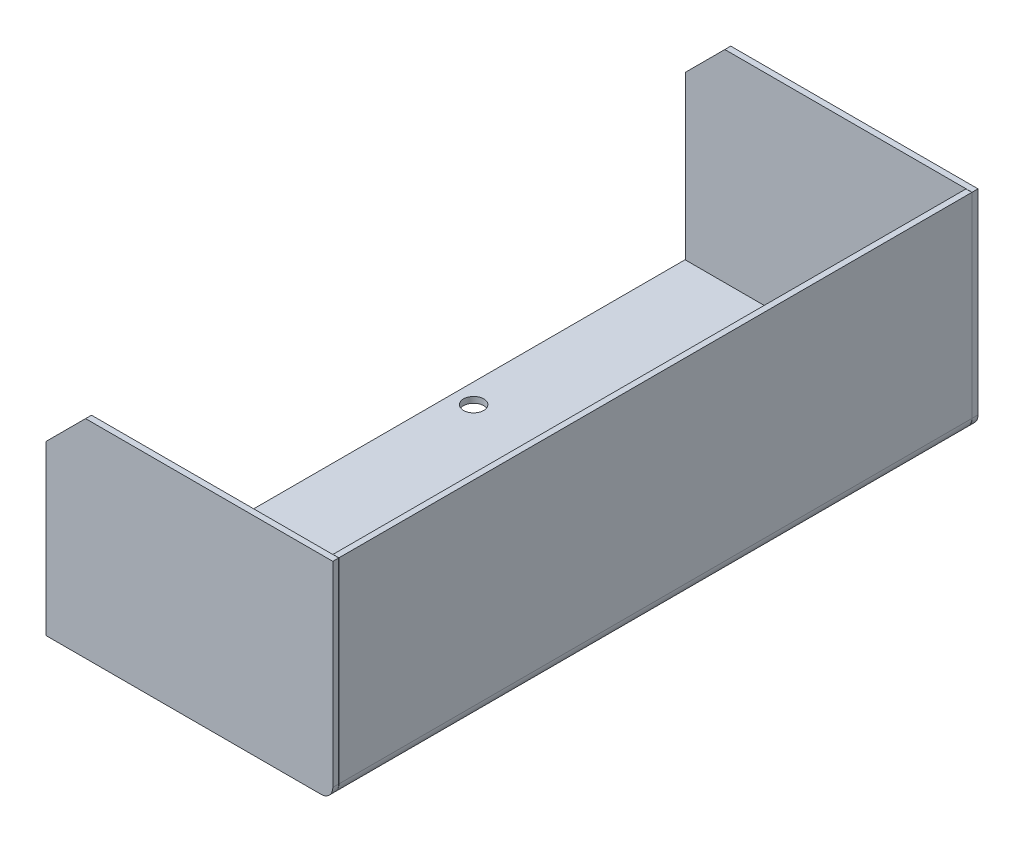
ISO-10303-21;
HEADER;
FILE_DESCRIPTION(('STEP AP214'),'2;1');
FILE_NAME('part.step','',(''),(''),'','','');
FILE_SCHEMA(('AUTOMOTIVE_DESIGN { 1 0 10303 214 1 1 1 1 }'));
ENDSEC;
DATA;
#1=APPLICATION_CONTEXT('core data for automotive mechanical design processes');
#2=APPLICATION_PROTOCOL_DEFINITION('international standard','automotive_design',2000,#1);
#3=PRODUCT_CONTEXT('',#1,'mechanical');
#4=PRODUCT('Part','Part','',(#3));
#5=PRODUCT_RELATED_PRODUCT_CATEGORY('part','',(#4));
#6=PRODUCT_DEFINITION_FORMATION('','',#4);
#7=PRODUCT_DEFINITION_CONTEXT('part definition',#1,'design');
#8=PRODUCT_DEFINITION('design','',#6,#7);
#9=PRODUCT_DEFINITION_SHAPE('','',#8);
#10=(LENGTH_UNIT() NAMED_UNIT(*) SI_UNIT(.MILLI.,.METRE.));
#11=(NAMED_UNIT(*) PLANE_ANGLE_UNIT() SI_UNIT($,.RADIAN.));
#12=(NAMED_UNIT(*) SI_UNIT($,.STERADIAN.) SOLID_ANGLE_UNIT());
#13=UNCERTAINTY_MEASURE_WITH_UNIT(LENGTH_MEASURE(1.E-05),#10,'distance_accuracy_value','');
#14=(GEOMETRIC_REPRESENTATION_CONTEXT(3) GLOBAL_UNCERTAINTY_ASSIGNED_CONTEXT((#13)) GLOBAL_UNIT_ASSIGNED_CONTEXT((#10,
#11,#12)) REPRESENTATION_CONTEXT('',''));
#15=CARTESIAN_POINT('',(0.,0.,0.));
#16=DIRECTION('',(0.,0.,1.));
#17=DIRECTION('',(1.,0.,0.));
#18=AXIS2_PLACEMENT_3D('',#15,#16,#17);
#19=CARTESIAN_POINT('',(-143.5,-1.49999999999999,323.1));
#20=DIRECTION('',(1.,0.,0.));
#21=DIRECTION('',(0.,0.,-1.));
#22=AXIS2_PLACEMENT_3D('',#19,#20,#21);
#23=PLANE('',#22);
#24=DIRECTION('',(0.,-1.,0.));
#25=VECTOR('',#24,1.);
#26=CARTESIAN_POINT('',(-143.5,-1.49999999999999,323.1));
#27=LINE('',#26,#25);
#28=CARTESIAN_POINT('',(-143.5,83.5,323.1));
#29=VERTEX_POINT('',#28);
#30=CARTESIAN_POINT('',(-143.5,-1.49999999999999,323.1));
#31=VERTEX_POINT('',#30);
#32=EDGE_CURVE('E135',#29,#31,#27,.T.);
#33=ORIENTED_EDGE('',*,*,#32,.F.);
#34=DIRECTION('',(0.,0.,-1.));
#35=VECTOR('',#34,1.);
#36=CARTESIAN_POINT('',(-143.5,83.5,323.1));
#37=LINE('',#36,#35);
#38=CARTESIAN_POINT('',(-143.5,83.5,320.1));
#39=VERTEX_POINT('',#38);
#40=EDGE_CURVE('E102',#29,#39,#37,.T.);
#41=ORIENTED_EDGE('',*,*,#40,.T.);
#42=DIRECTION('',(0.,-1.,0.));
#43=VECTOR('',#42,1.);
#44=CARTESIAN_POINT('',(-143.5,-1.49999999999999,320.1));
#45=LINE('',#44,#43);
#46=CARTESIAN_POINT('',(-143.5,-1.49999999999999,320.1));
#47=VERTEX_POINT('',#46);
#48=EDGE_CURVE('E96',#39,#47,#45,.T.);
#49=ORIENTED_EDGE('',*,*,#48,.T.);
#50=DIRECTION('',(0.,0.,-1.));
#51=VECTOR('',#50,1.);
#52=CARTESIAN_POINT('',(-143.5,-1.49999999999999,323.1));
#53=LINE('',#52,#51);
#54=EDGE_CURVE('E100',#31,#47,#53,.T.);
#55=ORIENTED_EDGE('',*,*,#54,.F.);
#56=EDGE_LOOP('',(#33,#41,#49,#55));
#57=FACE_BOUND('',#56,.T.);
#58=ADVANCED_FACE('F44',(#57),#23,.F.);
#59=CARTESIAN_POINT('',(-4.50000000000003,-1.49999999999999,323.1));
#60=DIRECTION('',(0.,1.,0.));
#61=DIRECTION('',(-1.,0.,0.));
#62=AXIS2_PLACEMENT_3D('',#59,#60,#61);
#63=PLANE('',#62);
#64=DIRECTION('',(1.,0.,0.));
#65=VECTOR('',#64,1.);
#66=CARTESIAN_POINT('',(-4.50000000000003,-1.49999999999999,320.1));
#67=LINE('',#66,#65);
#68=CARTESIAN_POINT('',(-4.50000000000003,-1.49999999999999,320.1));
#69=VERTEX_POINT('',#68);
#70=EDGE_CURVE('E103',#47,#69,#67,.T.);
#71=ORIENTED_EDGE('',*,*,#70,.T.);
#72=DIRECTION('',(0.,0.,-1.));
#73=VECTOR('',#72,1.);
#74=CARTESIAN_POINT('',(-4.50000000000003,-1.49999999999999,323.1));
#75=LINE('',#74,#73);
#76=CARTESIAN_POINT('',(-4.50000000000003,-1.49999999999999,323.1));
#77=VERTEX_POINT('',#76);
#78=EDGE_CURVE('E116',#77,#69,#75,.T.);
#79=ORIENTED_EDGE('',*,*,#78,.F.);
#80=DIRECTION('',(1.,0.,0.));
#81=VECTOR('',#80,1.);
#82=CARTESIAN_POINT('',(-4.50000000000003,-1.49999999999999,323.1));
#83=LINE('',#82,#81);
#84=EDGE_CURVE('E115',#31,#77,#83,.T.);
#85=ORIENTED_EDGE('',*,*,#84,.F.);
#86=ORIENTED_EDGE('',*,*,#54,.T.);
#87=EDGE_LOOP('',(#71,#79,#85,#86));
#88=FACE_BOUND('',#87,.T.);
#89=ADVANCED_FACE('F114',(#88),#63,.F.);
#90=CARTESIAN_POINT('',(-4.50000000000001,4.50000000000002,323.1));
#91=DIRECTION('',(0.,0.,-1.));
#92=DIRECTION('',(-1.,0.,0.));
#93=AXIS2_PLACEMENT_3D('',#90,#91,#92);
#94=CYLINDRICAL_SURFACE('',#93,6.00000000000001);
#95=CARTESIAN_POINT('',(-4.50000000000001,4.50000000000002,320.1));
#96=DIRECTION('',(0.,0.,1.));
#97=DIRECTION('',(-1.,0.,0.));
#98=AXIS2_PLACEMENT_3D('',#95,#96,#97);
#99=CIRCLE('',#98,6.00000000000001);
#100=CARTESIAN_POINT('',(1.50000000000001,4.50000000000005,320.1));
#101=VERTEX_POINT('',#100);
#102=EDGE_CURVE('E108',#69,#101,#99,.T.);
#103=ORIENTED_EDGE('',*,*,#102,.T.);
#104=DIRECTION('',(0.,0.,-1.));
#105=VECTOR('',#104,1.);
#106=CARTESIAN_POINT('',(1.50000000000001,4.50000000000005,323.1));
#107=LINE('',#106,#105);
#108=CARTESIAN_POINT('',(1.50000000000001,4.50000000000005,323.1));
#109=VERTEX_POINT('',#108);
#110=EDGE_CURVE('E119',#109,#101,#107,.T.);
#111=ORIENTED_EDGE('',*,*,#110,.F.);
#112=CARTESIAN_POINT('',(-4.50000000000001,4.50000000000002,323.1));
#113=DIRECTION('',(0.,0.,1.));
#114=DIRECTION('',(-1.,0.,0.));
#115=AXIS2_PLACEMENT_3D('',#112,#113,#114);
#116=CIRCLE('',#115,6.00000000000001);
#117=EDGE_CURVE('E132',#77,#109,#116,.T.);
#118=ORIENTED_EDGE('',*,*,#117,.F.);
#119=ORIENTED_EDGE('',*,*,#78,.T.);
#120=EDGE_LOOP('',(#103,#111,#118,#119));
#121=FACE_BOUND('',#120,.T.);
#122=ADVANCED_FACE('F143',(#121),#94,.T.);
#123=CARTESIAN_POINT('',(1.50000000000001,4.50000000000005,323.1));
#124=DIRECTION('',(-1.,0.,0.));
#125=DIRECTION('',(0.,-1.,0.));
#126=AXIS2_PLACEMENT_3D('',#123,#124,#125);
#127=PLANE('',#126);
#128=DIRECTION('',(0.,1.,0.));
#129=VECTOR('',#128,1.);
#130=CARTESIAN_POINT('',(1.50000000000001,4.50000000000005,320.1));
#131=LINE('',#130,#129);
#132=CARTESIAN_POINT('',(1.50000000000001,103.5,320.1));
#133=VERTEX_POINT('',#132);
#134=EDGE_CURVE('E139',#101,#133,#131,.T.);
#135=ORIENTED_EDGE('',*,*,#134,.T.);
#136=DIRECTION('',(0.,0.,-1.));
#137=VECTOR('',#136,1.);
#138=CARTESIAN_POINT('',(1.50000000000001,103.5,323.1));
#139=LINE('',#138,#137);
#140=CARTESIAN_POINT('',(1.50000000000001,103.5,323.1));
#141=VERTEX_POINT('',#140);
#142=EDGE_CURVE('E125',#141,#133,#139,.T.);
#143=ORIENTED_EDGE('',*,*,#142,.F.);
#144=DIRECTION('',(0.,1.,0.));
#145=VECTOR('',#144,1.);
#146=CARTESIAN_POINT('',(1.50000000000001,4.50000000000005,323.1));
#147=LINE('',#146,#145);
#148=EDGE_CURVE('E130',#109,#141,#147,.T.);
#149=ORIENTED_EDGE('',*,*,#148,.F.);
#150=ORIENTED_EDGE('',*,*,#110,.T.);
#151=EDGE_LOOP('',(#135,#143,#149,#150));
#152=FACE_BOUND('',#151,.T.);
#153=ADVANCED_FACE('F147',(#152),#127,.F.);
#154=CARTESIAN_POINT('',(-143.5,103.5,323.1));
#155=DIRECTION('',(0.,-1.,0.));
#156=DIRECTION('',(0.,0.,-1.));
#157=AXIS2_PLACEMENT_3D('',#154,#155,#156);
#158=PLANE('',#157);
#159=DIRECTION('',(-1.,0.,0.));
#160=VECTOR('',#159,1.);
#161=CARTESIAN_POINT('',(-143.5,103.5,320.1));
#162=LINE('',#161,#160);
#163=CARTESIAN_POINT('',(-123.5,103.5,320.1));
#164=VERTEX_POINT('',#163);
#165=EDGE_CURVE('E137',#133,#164,#162,.T.);
#166=ORIENTED_EDGE('',*,*,#165,.T.);
#167=DIRECTION('',(0.,0.,1.));
#168=VECTOR('',#167,1.);
#169=CARTESIAN_POINT('',(-123.5,103.5,323.1));
#170=LINE('',#169,#168);
#171=CARTESIAN_POINT('',(-123.5,103.5,323.1));
#172=VERTEX_POINT('',#171);
#173=EDGE_CURVE('E51',#164,#172,#170,.T.);
#174=ORIENTED_EDGE('',*,*,#173,.T.);
#175=DIRECTION('',(-1.,0.,0.));
#176=VECTOR('',#175,1.);
#177=CARTESIAN_POINT('',(-143.5,103.5,323.1));
#178=LINE('',#177,#176);
#179=EDGE_CURVE('E128',#141,#172,#178,.T.);
#180=ORIENTED_EDGE('',*,*,#179,.F.);
#181=ORIENTED_EDGE('',*,*,#142,.T.);
#182=EDGE_LOOP('',(#166,#174,#180,#181));
#183=FACE_BOUND('',#182,.T.);
#184=ADVANCED_FACE('F149',(#183),#158,.F.);
#185=CARTESIAN_POINT('',(-4.50000000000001,4.50000000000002,323.1));
#186=DIRECTION('',(0.,0.,-1.));
#187=DIRECTION('',(-1.,0.,0.));
#188=AXIS2_PLACEMENT_3D('',#185,#186,#187);
#189=PLANE('',#188);
#190=ORIENTED_EDGE('',*,*,#179,.T.);
#191=DIRECTION('',(0.707106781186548,0.707106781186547,0.));
#192=VECTOR('',#191,1.);
#193=CARTESIAN_POINT('',(-143.5,83.5,323.1));
#194=LINE('',#193,#192);
#195=EDGE_CURVE('E13',#172,#29,#194,.F.);
#196=ORIENTED_EDGE('',*,*,#195,.T.);
#197=ORIENTED_EDGE('',*,*,#32,.T.);
#198=ORIENTED_EDGE('',*,*,#84,.T.);
#199=ORIENTED_EDGE('',*,*,#117,.T.);
#200=ORIENTED_EDGE('',*,*,#148,.T.);
#201=EDGE_LOOP('',(#190,#196,#197,#198,#199,#200));
#202=FACE_BOUND('',#201,.T.);
#203=ADVANCED_FACE('F154',(#202),#189,.F.);
#204=CARTESIAN_POINT('',(-4.50000000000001,4.50000000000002,320.1));
#205=DIRECTION('',(0.,0.,-1.));
#206=DIRECTION('',(-1.,0.,0.));
#207=AXIS2_PLACEMENT_3D('',#204,#205,#206);
#208=PLANE('',#207);
#209=ORIENTED_EDGE('',*,*,#48,.F.);
#210=DIRECTION('',(-0.707106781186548,-0.707106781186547,0.));
#211=VECTOR('',#210,1.);
#212=CARTESIAN_POINT('',(-113.5,113.5,320.1));
#213=LINE('',#212,#211);
#214=EDGE_CURVE('E65',#39,#164,#213,.F.);
#215=ORIENTED_EDGE('',*,*,#214,.T.);
#216=ORIENTED_EDGE('',*,*,#165,.F.);
#217=ORIENTED_EDGE('',*,*,#134,.F.);
#218=ORIENTED_EDGE('',*,*,#102,.F.);
#219=ORIENTED_EDGE('',*,*,#70,.F.);
#220=EDGE_LOOP('',(#209,#215,#216,#217,#218,#219));
#221=FACE_BOUND('',#220,.T.);
#222=ADVANCED_FACE('F106',(#221),#208,.T.);
#223=CARTESIAN_POINT('',(-143.5,83.5,323.1));
#224=DIRECTION('',(0.707106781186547,-0.707106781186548,0.));
#225=DIRECTION('',(0.707106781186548,0.707106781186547,0.));
#226=AXIS2_PLACEMENT_3D('',#223,#224,#225);
#227=PLANE('',#226);
#228=ORIENTED_EDGE('',*,*,#195,.F.);
#229=ORIENTED_EDGE('',*,*,#173,.F.);
#230=ORIENTED_EDGE('',*,*,#214,.F.);
#231=ORIENTED_EDGE('',*,*,#40,.F.);
#232=EDGE_LOOP('',(#228,#229,#230,#231));
#233=FACE_BOUND('',#232,.T.);
#234=ADVANCED_FACE('F152',(#233),#227,.F.);
#235=CLOSED_SHELL('',(#58,#89,#122,#153,#184,#203,#222,#234));
#236=MANIFOLD_SOLID_BREP('B2',#235);
#237=CARTESIAN_POINT('',(1.50000000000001,103.5,-3.1));
#238=DIRECTION('',(-1.,0.,0.));
#239=DIRECTION('',(0.,-1.,0.));
#240=AXIS2_PLACEMENT_3D('',#237,#238,#239);
#241=PLANE('',#240);
#242=DIRECTION('',(0.,-1.,0.));
#243=VECTOR('',#242,1.);
#244=CARTESIAN_POINT('',(1.50000000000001,103.5,-0.1));
#245=LINE('',#244,#243);
#246=CARTESIAN_POINT('',(1.50000000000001,103.5,-0.1));
#247=VERTEX_POINT('',#246);
#248=CARTESIAN_POINT('',(1.5,4.50000000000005,-0.1));
#249=VERTEX_POINT('',#248);
#250=EDGE_CURVE('E283',#247,#249,#245,.T.);
#251=ORIENTED_EDGE('',*,*,#250,.T.);
#252=DIRECTION('',(0.,0.,1.));
#253=VECTOR('',#252,1.);
#254=CARTESIAN_POINT('',(1.5,4.50000000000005,-3.1));
#255=LINE('',#254,#253);
#256=CARTESIAN_POINT('',(1.5,4.50000000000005,-3.1));
#257=VERTEX_POINT('',#256);
#258=EDGE_CURVE('E290',#257,#249,#255,.T.);
#259=ORIENTED_EDGE('',*,*,#258,.F.);
#260=DIRECTION('',(0.,-1.,0.));
#261=VECTOR('',#260,1.);
#262=CARTESIAN_POINT('',(1.50000000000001,103.5,-3.1));
#263=LINE('',#262,#261);
#264=CARTESIAN_POINT('',(1.50000000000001,103.5,-3.1));
#265=VERTEX_POINT('',#264);
#266=EDGE_CURVE('E309',#265,#257,#263,.T.);
#267=ORIENTED_EDGE('',*,*,#266,.F.);
#268=DIRECTION('',(0.,0.,1.));
#269=VECTOR('',#268,1.);
#270=CARTESIAN_POINT('',(1.50000000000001,103.5,-3.1));
#271=LINE('',#270,#269);
#272=EDGE_CURVE('E301',#265,#247,#271,.T.);
#273=ORIENTED_EDGE('',*,*,#272,.T.);
#274=EDGE_LOOP('',(#251,#259,#267,#273));
#275=FACE_BOUND('',#274,.T.);
#276=ADVANCED_FACE('F228',(#275),#241,.F.);
#277=CARTESIAN_POINT('',(-4.5,4.50000000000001,-3.1));
#278=DIRECTION('',(0.,0.,1.));
#279=DIRECTION('',(1.,0.,0.));
#280=AXIS2_PLACEMENT_3D('',#277,#278,#279);
#281=CYLINDRICAL_SURFACE('',#280,6.);
#282=CARTESIAN_POINT('',(-4.5,4.50000000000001,-0.1));
#283=DIRECTION('',(0.,0.,-1.));
#284=DIRECTION('',(-1.,0.,0.));
#285=AXIS2_PLACEMENT_3D('',#282,#283,#284);
#286=CIRCLE('',#285,6.);
#287=CARTESIAN_POINT('',(-4.50000000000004,-1.49999999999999,-0.1));
#288=VERTEX_POINT('',#287);
#289=EDGE_CURVE('E279',#249,#288,#286,.T.);
#290=ORIENTED_EDGE('',*,*,#289,.T.);
#291=DIRECTION('',(0.,0.,1.));
#292=VECTOR('',#291,1.);
#293=CARTESIAN_POINT('',(-4.50000000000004,-1.49999999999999,-3.1));
#294=LINE('',#293,#292);
#295=CARTESIAN_POINT('',(-4.50000000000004,-1.49999999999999,-3.1));
#296=VERTEX_POINT('',#295);
#297=EDGE_CURVE('E297',#296,#288,#294,.T.);
#298=ORIENTED_EDGE('',*,*,#297,.F.);
#299=CARTESIAN_POINT('',(-4.5,4.50000000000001,-3.1));
#300=DIRECTION('',(0.,0.,-1.));
#301=DIRECTION('',(-1.,0.,0.));
#302=AXIS2_PLACEMENT_3D('',#299,#300,#301);
#303=CIRCLE('',#302,6.);
#304=EDGE_CURVE('E292',#257,#296,#303,.T.);
#305=ORIENTED_EDGE('',*,*,#304,.F.);
#306=ORIENTED_EDGE('',*,*,#258,.T.);
#307=EDGE_LOOP('',(#290,#298,#305,#306));
#308=FACE_BOUND('',#307,.T.);
#309=ADVANCED_FACE('F291',(#308),#281,.T.);
#310=CARTESIAN_POINT('',(-4.50000000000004,-1.49999999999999,-3.1));
#311=DIRECTION('',(0.,1.,0.));
#312=DIRECTION('',(0.,0.,1.));
#313=AXIS2_PLACEMENT_3D('',#310,#311,#312);
#314=PLANE('',#313);
#315=DIRECTION('',(-1.,0.,0.));
#316=VECTOR('',#315,1.);
#317=CARTESIAN_POINT('',(-4.50000000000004,-1.49999999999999,-0.1));
#318=LINE('',#317,#316);
#319=CARTESIAN_POINT('',(-143.5,-1.49999999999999,-0.1));
#320=VERTEX_POINT('',#319);
#321=EDGE_CURVE('E284',#288,#320,#318,.T.);
#322=ORIENTED_EDGE('',*,*,#321,.T.);
#323=DIRECTION('',(0.,0.,1.));
#324=VECTOR('',#323,1.);
#325=CARTESIAN_POINT('',(-143.5,-1.49999999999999,-3.1));
#326=LINE('',#325,#324);
#327=CARTESIAN_POINT('',(-143.5,-1.49999999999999,-3.1));
#328=VERTEX_POINT('',#327);
#329=EDGE_CURVE('E319',#328,#320,#326,.T.);
#330=ORIENTED_EDGE('',*,*,#329,.F.);
#331=DIRECTION('',(-1.,0.,0.));
#332=VECTOR('',#331,1.);
#333=CARTESIAN_POINT('',(-4.50000000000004,-1.49999999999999,-3.1));
#334=LINE('',#333,#332);
#335=EDGE_CURVE('E312',#296,#328,#334,.T.);
#336=ORIENTED_EDGE('',*,*,#335,.F.);
#337=ORIENTED_EDGE('',*,*,#297,.T.);
#338=EDGE_LOOP('',(#322,#330,#336,#337));
#339=FACE_BOUND('',#338,.T.);
#340=ADVANCED_FACE('F338',(#339),#314,.F.);
#341=CARTESIAN_POINT('',(-143.5,103.5,-3.1));
#342=DIRECTION('',(1.,0.,0.));
#343=DIRECTION('',(0.,0.,-1.));
#344=AXIS2_PLACEMENT_3D('',#341,#342,#343);
#345=PLANE('',#344);
#346=DIRECTION('',(0.,1.,0.));
#347=VECTOR('',#346,1.);
#348=CARTESIAN_POINT('',(-143.5,103.5,-0.1));
#349=LINE('',#348,#347);
#350=CARTESIAN_POINT('',(-143.5,83.4999999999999,-0.1));
#351=VERTEX_POINT('',#350);
#352=EDGE_CURVE('E305',#320,#351,#349,.T.);
#353=ORIENTED_EDGE('',*,*,#352,.T.);
#354=DIRECTION('',(0.,0.,-1.));
#355=VECTOR('',#354,1.);
#356=CARTESIAN_POINT('',(-143.5,83.4999999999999,-3.1));
#357=LINE('',#356,#355);
#358=CARTESIAN_POINT('',(-143.5,83.4999999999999,-3.1));
#359=VERTEX_POINT('',#358);
#360=EDGE_CURVE('E235',#351,#359,#357,.T.);
#361=ORIENTED_EDGE('',*,*,#360,.T.);
#362=DIRECTION('',(0.,1.,0.));
#363=VECTOR('',#362,1.);
#364=CARTESIAN_POINT('',(-143.5,103.5,-3.1));
#365=LINE('',#364,#363);
#366=EDGE_CURVE('E314',#328,#359,#365,.T.);
#367=ORIENTED_EDGE('',*,*,#366,.F.);
#368=ORIENTED_EDGE('',*,*,#329,.T.);
#369=EDGE_LOOP('',(#353,#361,#367,#368));
#370=FACE_BOUND('',#369,.T.);
#371=ADVANCED_FACE('F336',(#370),#345,.F.);
#372=CARTESIAN_POINT('',(1.50000000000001,103.5,-3.1));
#373=DIRECTION('',(0.,-1.,0.));
#374=DIRECTION('',(0.,0.,-1.));
#375=AXIS2_PLACEMENT_3D('',#372,#373,#374);
#376=PLANE('',#375);
#377=DIRECTION('',(1.,0.,0.));
#378=VECTOR('',#377,1.);
#379=CARTESIAN_POINT('',(1.50000000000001,103.5,-3.1));
#380=LINE('',#379,#378);
#381=CARTESIAN_POINT('',(-123.5,103.5,-3.1));
#382=VERTEX_POINT('',#381);
#383=EDGE_CURVE('E316',#382,#265,#380,.T.);
#384=ORIENTED_EDGE('',*,*,#383,.F.);
#385=DIRECTION('',(0.,0.,1.));
#386=VECTOR('',#385,1.);
#387=CARTESIAN_POINT('',(-123.5,103.5,-3.1));
#388=LINE('',#387,#386);
#389=CARTESIAN_POINT('',(-123.5,103.5,-0.0999999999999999));
#390=VERTEX_POINT('',#389);
#391=EDGE_CURVE('E296',#382,#390,#388,.T.);
#392=ORIENTED_EDGE('',*,*,#391,.T.);
#393=DIRECTION('',(1.,0.,0.));
#394=VECTOR('',#393,1.);
#395=CARTESIAN_POINT('',(1.50000000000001,103.5,-0.1));
#396=LINE('',#395,#394);
#397=EDGE_CURVE('E307',#390,#247,#396,.T.);
#398=ORIENTED_EDGE('',*,*,#397,.T.);
#399=ORIENTED_EDGE('',*,*,#272,.F.);
#400=EDGE_LOOP('',(#384,#392,#398,#399));
#401=FACE_BOUND('',#400,.T.);
#402=ADVANCED_FACE('F328',(#401),#376,.F.);
#403=CARTESIAN_POINT('',(-4.5,4.50000000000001,-3.1));
#404=DIRECTION('',(0.,0.,-1.));
#405=DIRECTION('',(-1.,0.,0.));
#406=AXIS2_PLACEMENT_3D('',#403,#404,#405);
#407=PLANE('',#406);
#408=ORIENTED_EDGE('',*,*,#366,.T.);
#409=DIRECTION('',(-0.707106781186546,-0.707106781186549,0.));
#410=VECTOR('',#409,1.);
#411=CARTESIAN_POINT('',(-113.5,113.5,-3.1));
#412=LINE('',#411,#410);
#413=EDGE_CURVE('E42',#359,#382,#412,.F.);
#414=ORIENTED_EDGE('',*,*,#413,.T.);
#415=ORIENTED_EDGE('',*,*,#383,.T.);
#416=ORIENTED_EDGE('',*,*,#266,.T.);
#417=ORIENTED_EDGE('',*,*,#304,.T.);
#418=ORIENTED_EDGE('',*,*,#335,.T.);
#419=EDGE_LOOP('',(#408,#414,#415,#416,#417,#418));
#420=FACE_BOUND('',#419,.T.);
#421=ADVANCED_FACE('F333',(#420),#407,.T.);
#422=CARTESIAN_POINT('',(-4.5,4.50000000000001,-0.1));
#423=DIRECTION('',(0.,0.,-1.));
#424=DIRECTION('',(-1.,0.,0.));
#425=AXIS2_PLACEMENT_3D('',#422,#423,#424);
#426=PLANE('',#425);
#427=ORIENTED_EDGE('',*,*,#397,.F.);
#428=DIRECTION('',(0.707106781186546,0.707106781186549,0.));
#429=VECTOR('',#428,1.);
#430=CARTESIAN_POINT('',(-123.5,103.5,-0.0999999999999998));
#431=LINE('',#430,#429);
#432=EDGE_CURVE('E249',#390,#351,#431,.F.);
#433=ORIENTED_EDGE('',*,*,#432,.T.);
#434=ORIENTED_EDGE('',*,*,#352,.F.);
#435=ORIENTED_EDGE('',*,*,#321,.F.);
#436=ORIENTED_EDGE('',*,*,#289,.F.);
#437=ORIENTED_EDGE('',*,*,#250,.F.);
#438=EDGE_LOOP('',(#427,#433,#434,#435,#436,#437));
#439=FACE_BOUND('',#438,.T.);
#440=ADVANCED_FACE('F281',(#439),#426,.F.);
#441=CARTESIAN_POINT('',(-123.5,103.5,-3.1));
#442=DIRECTION('',(0.707106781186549,-0.707106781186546,0.));
#443=DIRECTION('',(0.707106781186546,0.707106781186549,0.));
#444=AXIS2_PLACEMENT_3D('',#441,#442,#443);
#445=PLANE('',#444);
#446=ORIENTED_EDGE('',*,*,#413,.F.);
#447=ORIENTED_EDGE('',*,*,#360,.F.);
#448=ORIENTED_EDGE('',*,*,#432,.F.);
#449=ORIENTED_EDGE('',*,*,#391,.F.);
#450=EDGE_LOOP('',(#446,#447,#448,#449));
#451=FACE_BOUND('',#450,.T.);
#452=ADVANCED_FACE('F331',(#451),#445,.F.);
#453=CLOSED_SHELL('',(#276,#309,#340,#371,#402,#421,#440,#452));
#454=MANIFOLD_SOLID_BREP('B7',#453);
#455=CARTESIAN_POINT('',(-143.5,-1.49999999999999,320.));
#456=DIRECTION('',(1.,0.,0.));
#457=DIRECTION('',(0.,0.,-1.));
#458=AXIS2_PLACEMENT_3D('',#455,#456,#457);
#459=PLANE('',#458);
#460=DIRECTION('',(0.,-1.,0.));
#461=VECTOR('',#460,1.);
#462=CARTESIAN_POINT('',(-143.5,-1.49999999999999,0.));
#463=LINE('',#462,#461);
#464=CARTESIAN_POINT('',(-143.5,1.5,0.));
#465=VERTEX_POINT('',#464);
#466=CARTESIAN_POINT('',(-143.5,-1.49999999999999,0.));
#467=VERTEX_POINT('',#466);
#468=EDGE_CURVE('E471',#465,#467,#463,.T.);
#469=ORIENTED_EDGE('',*,*,#468,.T.);
#470=DIRECTION('',(0.,0.,-1.));
#471=VECTOR('',#470,1.);
#472=CARTESIAN_POINT('',(-143.5,-1.49999999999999,320.));
#473=LINE('',#472,#471);
#474=CARTESIAN_POINT('',(-143.5,-1.49999999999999,320.));
#475=VERTEX_POINT('',#474);
#476=EDGE_CURVE('E226',#475,#467,#473,.T.);
#477=ORIENTED_EDGE('',*,*,#476,.F.);
#478=DIRECTION('',(0.,-1.,0.));
#479=VECTOR('',#478,1.);
#480=CARTESIAN_POINT('',(-143.5,-1.49999999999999,320.));
#481=LINE('',#480,#479);
#482=CARTESIAN_POINT('',(-143.5,1.5,320.));
#483=VERTEX_POINT('',#482);
#484=EDGE_CURVE('E503',#483,#475,#481,.T.);
#485=ORIENTED_EDGE('',*,*,#484,.F.);
#486=DIRECTION('',(0.,0.,-1.));
#487=VECTOR('',#486,1.);
#488=CARTESIAN_POINT('',(-143.5,1.5,320.));
#489=LINE('',#488,#487);
#490=EDGE_CURVE('E484',#483,#465,#489,.T.);
#491=ORIENTED_EDGE('',*,*,#490,.T.);
#492=EDGE_LOOP('',(#469,#477,#485,#491));
#493=FACE_BOUND('',#492,.T.);
#494=ADVANCED_FACE('F403',(#493),#459,.F.);
#495=CARTESIAN_POINT('',(-143.5,-1.49999999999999,320.));
#496=DIRECTION('',(0.,1.,0.));
#497=DIRECTION('',(-1.,0.,0.));
#498=AXIS2_PLACEMENT_3D('',#495,#496,#497);
#499=PLANE('',#498);
#500=CARTESIAN_POINT('',(-61.,-1.49999999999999,13.9));
#501=DIRECTION('',(0.,-1.,0.));
#502=DIRECTION('',(1.,0.,0.));
#503=AXIS2_PLACEMENT_3D('',#500,#501,#502);
#504=CIRCLE('',#503,4.1);
#505=CARTESIAN_POINT('',(-56.9,-1.49999999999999,13.9));
#506=VERTEX_POINT('',#505);
#507=EDGE_CURVE('E651',#506,#506,#504,.T.);
#508=ORIENTED_EDGE('',*,*,#507,.F.);
#509=EDGE_LOOP('',(#508));
#510=FACE_BOUND('',#509,.T.);
#511=CARTESIAN_POINT('',(-133.5,-1.49999999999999,116.9));
#512=DIRECTION('',(0.,-1.,0.));
#513=DIRECTION('',(1.,0.,0.));
#514=AXIS2_PLACEMENT_3D('',#511,#512,#513);
#515=CIRCLE('',#514,5.09999999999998);
#516=CARTESIAN_POINT('',(-128.4,-1.49999999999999,116.9));
#517=VERTEX_POINT('',#516);
#518=EDGE_CURVE('E654',#517,#517,#515,.T.);
#519=ORIENTED_EDGE('',*,*,#518,.F.);
#520=EDGE_LOOP('',(#519));
#521=FACE_BOUND('',#520,.T.);
#522=CARTESIAN_POINT('',(-101.,-1.49999999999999,266.9));
#523=DIRECTION('',(0.,-1.,0.));
#524=DIRECTION('',(1.,0.,0.));
#525=AXIS2_PLACEMENT_3D('',#522,#523,#524);
#526=CIRCLE('',#525,4.09999999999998);
#527=CARTESIAN_POINT('',(-96.9,-1.49999999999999,266.9));
#528=VERTEX_POINT('',#527);
#529=EDGE_CURVE('E488',#528,#528,#526,.T.);
#530=ORIENTED_EDGE('',*,*,#529,.F.);
#531=EDGE_LOOP('',(#530));
#532=FACE_BOUND('',#531,.T.);
#533=DIRECTION('',(1.,0.,0.));
#534=VECTOR('',#533,1.);
#535=CARTESIAN_POINT('',(-143.5,-1.49999999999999,0.));
#536=LINE('',#535,#534);
#537=CARTESIAN_POINT('',(-4.50000000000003,-1.49999999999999,0.));
#538=VERTEX_POINT('',#537);
#539=EDGE_CURVE('E467',#467,#538,#536,.T.);
#540=ORIENTED_EDGE('',*,*,#539,.T.);
#541=DIRECTION('',(0.,0.,-1.));
#542=VECTOR('',#541,1.);
#543=CARTESIAN_POINT('',(-4.50000000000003,-1.49999999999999,320.));
#544=LINE('',#543,#542);
#545=CARTESIAN_POINT('',(-4.50000000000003,-1.49999999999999,320.));
#546=VERTEX_POINT('',#545);
#547=EDGE_CURVE('E410',#546,#538,#544,.T.);
#548=ORIENTED_EDGE('',*,*,#547,.F.);
#549=DIRECTION('',(1.,0.,0.));
#550=VECTOR('',#549,1.);
#551=CARTESIAN_POINT('',(-143.5,-1.49999999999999,320.));
#552=LINE('',#551,#550);
#553=EDGE_CURVE('E480',#475,#546,#552,.T.);
#554=ORIENTED_EDGE('',*,*,#553,.F.);
#555=ORIENTED_EDGE('',*,*,#476,.T.);
#556=EDGE_LOOP('',(#540,#548,#554,#555));
#557=FACE_BOUND('',#556,.T.);
#558=ADVANCED_FACE('F479',(#510,#521,#532,#557),#499,.F.);
#559=CARTESIAN_POINT('',(-4.49999999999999,4.50000000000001,320.));
#560=DIRECTION('',(0.,0.,-1.));
#561=DIRECTION('',(-1.,0.,0.));
#562=AXIS2_PLACEMENT_3D('',#559,#560,#561);
#563=CYLINDRICAL_SURFACE('',#562,6.);
#564=CARTESIAN_POINT('',(-4.49999999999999,4.50000000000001,0.));
#565=DIRECTION('',(0.,0.,1.));
#566=DIRECTION('',(-1.,0.,0.));
#567=AXIS2_PLACEMENT_3D('',#564,#565,#566);
#568=CIRCLE('',#567,6.);
#569=CARTESIAN_POINT('',(1.50000000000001,4.50000000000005,0.));
#570=VERTEX_POINT('',#569);
#571=EDGE_CURVE('E473',#538,#570,#568,.T.);
#572=ORIENTED_EDGE('',*,*,#571,.T.);
#573=DIRECTION('',(0.,0.,-1.));
#574=VECTOR('',#573,1.);
#575=CARTESIAN_POINT('',(1.50000000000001,4.50000000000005,320.));
#576=LINE('',#575,#574);
#577=CARTESIAN_POINT('',(1.50000000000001,4.50000000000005,320.));
#578=VERTEX_POINT('',#577);
#579=EDGE_CURVE('E529',#578,#570,#576,.T.);
#580=ORIENTED_EDGE('',*,*,#579,.F.);
#581=CARTESIAN_POINT('',(-4.49999999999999,4.50000000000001,320.));
#582=DIRECTION('',(0.,0.,1.));
#583=DIRECTION('',(-1.,0.,0.));
#584=AXIS2_PLACEMENT_3D('',#581,#582,#583);
#585=CIRCLE('',#584,6.);
#586=EDGE_CURVE('E506',#546,#578,#585,.T.);
#587=ORIENTED_EDGE('',*,*,#586,.F.);
#588=ORIENTED_EDGE('',*,*,#547,.T.);
#589=EDGE_LOOP('',(#572,#580,#587,#588));
#590=FACE_BOUND('',#589,.T.);
#591=ADVANCED_FACE('F533',(#590),#563,.T.);
#592=CARTESIAN_POINT('',(1.49999999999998,103.5,320.));
#593=DIRECTION('',(-1.,0.,0.));
#594=DIRECTION('',(0.,-1.,0.));
#595=AXIS2_PLACEMENT_3D('',#592,#593,#594);
#596=PLANE('',#595);
#597=DIRECTION('',(0.,1.,0.));
#598=VECTOR('',#597,1.);
#599=CARTESIAN_POINT('',(1.49999999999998,103.5,0.));
#600=LINE('',#599,#598);
#601=CARTESIAN_POINT('',(1.49999999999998,103.5,0.));
#602=VERTEX_POINT('',#601);
#603=EDGE_CURVE('E493',#570,#602,#600,.T.);
#604=ORIENTED_EDGE('',*,*,#603,.T.);
#605=DIRECTION('',(0.,0.,-1.));
#606=VECTOR('',#605,1.);
#607=CARTESIAN_POINT('',(1.49999999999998,103.5,320.));
#608=LINE('',#607,#606);
#609=CARTESIAN_POINT('',(1.49999999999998,103.5,320.));
#610=VERTEX_POINT('',#609);
#611=EDGE_CURVE('E526',#610,#602,#608,.T.);
#612=ORIENTED_EDGE('',*,*,#611,.F.);
#613=DIRECTION('',(0.,1.,0.));
#614=VECTOR('',#613,1.);
#615=CARTESIAN_POINT('',(1.49999999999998,103.5,320.));
#616=LINE('',#615,#614);
#617=EDGE_CURVE('E508',#578,#610,#616,.T.);
#618=ORIENTED_EDGE('',*,*,#617,.F.);
#619=ORIENTED_EDGE('',*,*,#579,.T.);
#620=EDGE_LOOP('',(#604,#612,#618,#619));
#621=FACE_BOUND('',#620,.T.);
#622=ADVANCED_FACE('F541',(#621),#596,.F.);
#623=CARTESIAN_POINT('',(1.49999999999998,103.5,320.));
#624=DIRECTION('',(0.,-1.,0.));
#625=DIRECTION('',(0.,0.,-1.));
#626=AXIS2_PLACEMENT_3D('',#623,#624,#625);
#627=PLANE('',#626);
#628=DIRECTION('',(-1.,0.,0.));
#629=VECTOR('',#628,1.);
#630=CARTESIAN_POINT('',(1.49999999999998,103.5,0.));
#631=LINE('',#630,#629);
#632=CARTESIAN_POINT('',(-1.50000000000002,103.5,0.));
#633=VERTEX_POINT('',#632);
#634=EDGE_CURVE('E495',#602,#633,#631,.T.);
#635=ORIENTED_EDGE('',*,*,#634,.T.);
#636=DIRECTION('',(0.,0.,-1.));
#637=VECTOR('',#636,1.);
#638=CARTESIAN_POINT('',(-1.50000000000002,103.5,320.));
#639=LINE('',#638,#637);
#640=CARTESIAN_POINT('',(-1.50000000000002,103.5,320.));
#641=VERTEX_POINT('',#640);
#642=EDGE_CURVE('E523',#641,#633,#639,.T.);
#643=ORIENTED_EDGE('',*,*,#642,.F.);
#644=DIRECTION('',(-1.,0.,0.));
#645=VECTOR('',#644,1.);
#646=CARTESIAN_POINT('',(1.49999999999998,103.5,320.));
#647=LINE('',#646,#645);
#648=EDGE_CURVE('E510',#610,#641,#647,.T.);
#649=ORIENTED_EDGE('',*,*,#648,.F.);
#650=ORIENTED_EDGE('',*,*,#611,.T.);
#651=EDGE_LOOP('',(#635,#643,#649,#650));
#652=FACE_BOUND('',#651,.T.);
#653=ADVANCED_FACE('F544',(#652),#627,.F.);
#654=CARTESIAN_POINT('',(-1.50000000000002,103.5,320.));
#655=DIRECTION('',(1.,0.,0.));
#656=DIRECTION('',(0.,1.,0.));
#657=AXIS2_PLACEMENT_3D('',#654,#655,#656);
#658=PLANE('',#657);
#659=DIRECTION('',(0.,-1.,0.));
#660=VECTOR('',#659,1.);
#661=CARTESIAN_POINT('',(-1.50000000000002,103.5,0.));
#662=LINE('',#661,#660);
#663=CARTESIAN_POINT('',(-1.50000000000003,4.50000000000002,0.));
#664=VERTEX_POINT('',#663);
#665=EDGE_CURVE('E497',#633,#664,#662,.T.);
#666=ORIENTED_EDGE('',*,*,#665,.T.);
#667=DIRECTION('',(0.,0.,-1.));
#668=VECTOR('',#667,1.);
#669=CARTESIAN_POINT('',(-1.50000000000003,4.50000000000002,320.));
#670=LINE('',#669,#668);
#671=CARTESIAN_POINT('',(-1.50000000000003,4.50000000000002,320.));
#672=VERTEX_POINT('',#671);
#673=EDGE_CURVE('E520',#672,#664,#670,.T.);
#674=ORIENTED_EDGE('',*,*,#673,.F.);
#675=DIRECTION('',(0.,-1.,0.));
#676=VECTOR('',#675,1.);
#677=CARTESIAN_POINT('',(-1.50000000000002,103.5,320.));
#678=LINE('',#677,#676);
#679=EDGE_CURVE('E512',#641,#672,#678,.T.);
#680=ORIENTED_EDGE('',*,*,#679,.F.);
#681=ORIENTED_EDGE('',*,*,#642,.T.);
#682=EDGE_LOOP('',(#666,#674,#680,#681));
#683=FACE_BOUND('',#682,.T.);
#684=ADVANCED_FACE('F549',(#683),#658,.F.);
#685=CARTESIAN_POINT('',(-4.50000000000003,4.5,320.));
#686=DIRECTION('',(0.,0.,-1.));
#687=DIRECTION('',(-1.,0.,0.));
#688=AXIS2_PLACEMENT_3D('',#685,#686,#687);
#689=CYLINDRICAL_SURFACE('',#688,3.);
#690=CARTESIAN_POINT('',(-4.50000000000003,4.5,0.));
#691=DIRECTION('',(0.,0.,-1.));
#692=DIRECTION('',(-1.,0.,0.));
#693=AXIS2_PLACEMENT_3D('',#690,#691,#692);
#694=CIRCLE('',#693,3.);
#695=CARTESIAN_POINT('',(-4.50000000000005,1.5,0.));
#696=VERTEX_POINT('',#695);
#697=EDGE_CURVE('E499',#664,#696,#694,.T.);
#698=ORIENTED_EDGE('',*,*,#697,.T.);
#699=DIRECTION('',(0.,0.,-1.));
#700=VECTOR('',#699,1.);
#701=CARTESIAN_POINT('',(-4.50000000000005,1.5,320.));
#702=LINE('',#701,#700);
#703=CARTESIAN_POINT('',(-4.50000000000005,1.5,320.));
#704=VERTEX_POINT('',#703);
#705=EDGE_CURVE('E517',#704,#696,#702,.T.);
#706=ORIENTED_EDGE('',*,*,#705,.F.);
#707=CARTESIAN_POINT('',(-4.50000000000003,4.5,320.));
#708=DIRECTION('',(0.,0.,-1.));
#709=DIRECTION('',(-1.,0.,0.));
#710=AXIS2_PLACEMENT_3D('',#707,#708,#709);
#711=CIRCLE('',#710,3.);
#712=EDGE_CURVE('E422',#672,#704,#711,.T.);
#713=ORIENTED_EDGE('',*,*,#712,.F.);
#714=ORIENTED_EDGE('',*,*,#673,.T.);
#715=EDGE_LOOP('',(#698,#706,#713,#714));
#716=FACE_BOUND('',#715,.T.);
#717=ADVANCED_FACE('F552',(#716),#689,.F.);
#718=CARTESIAN_POINT('',(-143.5,1.5,320.));
#719=DIRECTION('',(0.,-1.,0.));
#720=DIRECTION('',(0.,0.,-1.));
#721=AXIS2_PLACEMENT_3D('',#718,#719,#720);
#722=PLANE('',#721);
#723=CARTESIAN_POINT('',(-61.,1.5,13.9));
#724=DIRECTION('',(0.,-1.,0.));
#725=DIRECTION('',(0.,0.,-1.));
#726=AXIS2_PLACEMENT_3D('',#723,#724,#725);
#727=CIRCLE('',#726,4.1);
#728=CARTESIAN_POINT('',(-61.,1.5,9.8));
#729=VERTEX_POINT('',#728);
#730=EDGE_CURVE('E653',#729,#729,#727,.F.);
#731=ORIENTED_EDGE('',*,*,#730,.F.);
#732=EDGE_LOOP('',(#731));
#733=FACE_BOUND('',#732,.T.);
#734=CARTESIAN_POINT('',(-133.5,1.5,116.9));
#735=DIRECTION('',(0.,-1.,0.));
#736=DIRECTION('',(0.,0.,-1.));
#737=AXIS2_PLACEMENT_3D('',#734,#735,#736);
#738=CIRCLE('',#737,5.09999999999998);
#739=CARTESIAN_POINT('',(-133.5,1.5,111.8));
#740=VERTEX_POINT('',#739);
#741=EDGE_CURVE('E657',#740,#740,#738,.F.);
#742=ORIENTED_EDGE('',*,*,#741,.F.);
#743=EDGE_LOOP('',(#742));
#744=FACE_BOUND('',#743,.T.);
#745=CARTESIAN_POINT('',(-101.,1.5,266.9));
#746=DIRECTION('',(0.,-1.,0.));
#747=DIRECTION('',(0.,0.,-1.));
#748=AXIS2_PLACEMENT_3D('',#745,#746,#747);
#749=CIRCLE('',#748,4.09999999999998);
#750=CARTESIAN_POINT('',(-101.,1.5,262.8));
#751=VERTEX_POINT('',#750);
#752=EDGE_CURVE('E485',#751,#751,#749,.F.);
#753=ORIENTED_EDGE('',*,*,#752,.F.);
#754=EDGE_LOOP('',(#753));
#755=FACE_BOUND('',#754,.T.);
#756=DIRECTION('',(-1.,0.,0.));
#757=VECTOR('',#756,1.);
#758=CARTESIAN_POINT('',(-143.5,1.5,0.));
#759=LINE('',#758,#757);
#760=EDGE_CURVE('E501',#696,#465,#759,.T.);
#761=ORIENTED_EDGE('',*,*,#760,.T.);
#762=ORIENTED_EDGE('',*,*,#490,.F.);
#763=DIRECTION('',(-1.,0.,0.));
#764=VECTOR('',#763,1.);
#765=CARTESIAN_POINT('',(-143.5,1.5,320.));
#766=LINE('',#765,#764);
#767=EDGE_CURVE('E417',#704,#483,#766,.T.);
#768=ORIENTED_EDGE('',*,*,#767,.F.);
#769=ORIENTED_EDGE('',*,*,#705,.T.);
#770=EDGE_LOOP('',(#761,#762,#768,#769));
#771=FACE_BOUND('',#770,.T.);
#772=ADVANCED_FACE('F554',(#733,#744,#755,#771),#722,.F.);
#773=CARTESIAN_POINT('',(-4.50000000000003,4.5,320.));
#774=DIRECTION('',(0.,0.,-1.));
#775=DIRECTION('',(-1.,0.,0.));
#776=AXIS2_PLACEMENT_3D('',#773,#774,#775);
#777=PLANE('',#776);
#778=ORIENTED_EDGE('',*,*,#484,.T.);
#779=ORIENTED_EDGE('',*,*,#553,.T.);
#780=ORIENTED_EDGE('',*,*,#586,.T.);
#781=ORIENTED_EDGE('',*,*,#617,.T.);
#782=ORIENTED_EDGE('',*,*,#648,.T.);
#783=ORIENTED_EDGE('',*,*,#679,.T.);
#784=ORIENTED_EDGE('',*,*,#712,.T.);
#785=ORIENTED_EDGE('',*,*,#767,.T.);
#786=EDGE_LOOP('',(#778,#779,#780,#781,#782,#783,#784,#785));
#787=FACE_BOUND('',#786,.T.);
#788=ADVANCED_FACE('F536',(#787),#777,.F.);
#789=CARTESIAN_POINT('',(-4.50000000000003,4.5,0.));
#790=DIRECTION('',(0.,0.,-1.));
#791=DIRECTION('',(-1.,0.,0.));
#792=AXIS2_PLACEMENT_3D('',#789,#790,#791);
#793=PLANE('',#792);
#794=ORIENTED_EDGE('',*,*,#468,.F.);
#795=ORIENTED_EDGE('',*,*,#760,.F.);
#796=ORIENTED_EDGE('',*,*,#697,.F.);
#797=ORIENTED_EDGE('',*,*,#665,.F.);
#798=ORIENTED_EDGE('',*,*,#634,.F.);
#799=ORIENTED_EDGE('',*,*,#603,.F.);
#800=ORIENTED_EDGE('',*,*,#571,.F.);
#801=ORIENTED_EDGE('',*,*,#539,.F.);
#802=EDGE_LOOP('',(#794,#795,#796,#797,#798,#799,#800,#801));
#803=FACE_BOUND('',#802,.T.);
#804=ADVANCED_FACE('F468',(#803),#793,.T.);
#805=CARTESIAN_POINT('',(-101.,103.501,266.9));
#806=DIRECTION('',(0.,-1.,0.));
#807=DIRECTION('',(1.,0.,0.));
#808=AXIS2_PLACEMENT_3D('',#805,#806,#807);
#809=CYLINDRICAL_SURFACE('',#808,4.09999999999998);
#810=ORIENTED_EDGE('',*,*,#529,.T.);
#811=EDGE_LOOP('',(#810));
#812=FACE_BOUND('',#811,.T.);
#813=ORIENTED_EDGE('',*,*,#752,.T.);
#814=EDGE_LOOP('',(#813));
#815=FACE_BOUND('',#814,.T.);
#816=ADVANCED_FACE('F606',(#812,#815),#809,.F.);
#817=CARTESIAN_POINT('',(-133.5,103.501,116.9));
#818=DIRECTION('',(0.,-1.,0.));
#819=DIRECTION('',(1.,0.,0.));
#820=AXIS2_PLACEMENT_3D('',#817,#818,#819);
#821=CYLINDRICAL_SURFACE('',#820,5.09999999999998);
#822=ORIENTED_EDGE('',*,*,#518,.T.);
#823=EDGE_LOOP('',(#822));
#824=FACE_BOUND('',#823,.T.);
#825=ORIENTED_EDGE('',*,*,#741,.T.);
#826=EDGE_LOOP('',(#825));
#827=FACE_BOUND('',#826,.T.);
#828=ADVANCED_FACE('F625',(#824,#827),#821,.F.);
#829=CARTESIAN_POINT('',(-61.,103.501,13.9));
#830=DIRECTION('',(0.,-1.,0.));
#831=DIRECTION('',(1.,0.,0.));
#832=AXIS2_PLACEMENT_3D('',#829,#830,#831);
#833=CYLINDRICAL_SURFACE('',#832,4.1);
#834=ORIENTED_EDGE('',*,*,#507,.T.);
#835=EDGE_LOOP('',(#834));
#836=FACE_BOUND('',#835,.T.);
#837=ORIENTED_EDGE('',*,*,#730,.T.);
#838=EDGE_LOOP('',(#837));
#839=FACE_BOUND('',#838,.T.);
#840=ADVANCED_FACE('F635',(#836,#839),#833,.F.);
#841=CLOSED_SHELL('',(#494,#558,#591,#622,#653,#684,#717,#772,#788,#804,#816,#828,#840));
#842=MANIFOLD_SOLID_BREP('B36',#841);
#843=ADVANCED_BREP_SHAPE_REPRESENTATION('',(#18,#236,#454,#842),#14);
#844=SHAPE_DEFINITION_REPRESENTATION(#9,#843);
ENDSEC;
END-ISO-10303-21;
